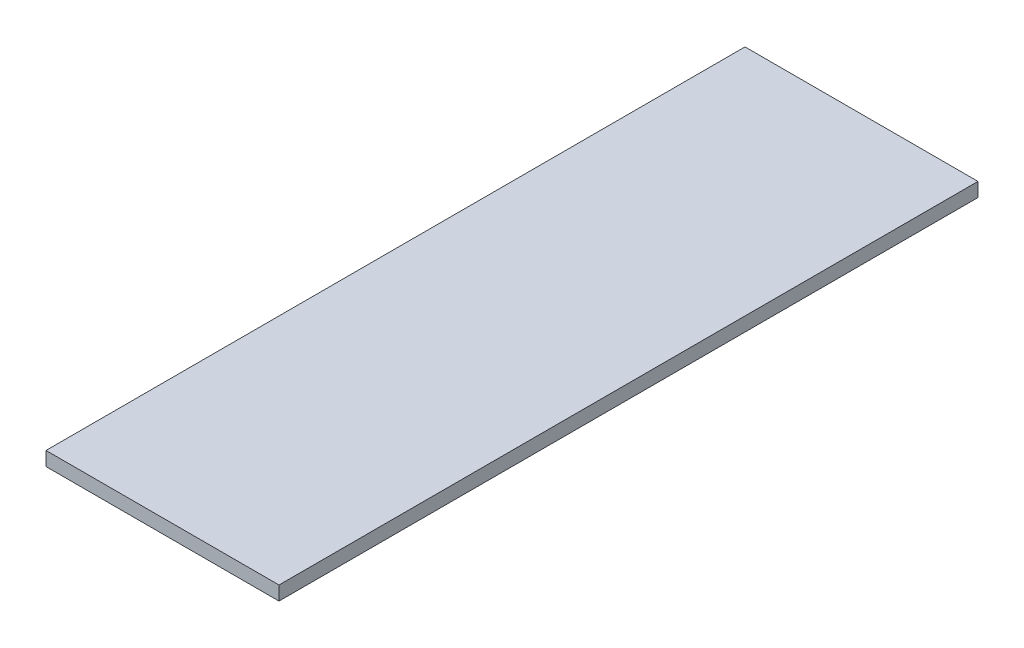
ISO-10303-21;
HEADER;
FILE_DESCRIPTION(('STEP AP214'),'2;1');
FILE_NAME('part.step','',(''),(''),'','','');
FILE_SCHEMA(('AUTOMOTIVE_DESIGN { 1 0 10303 214 1 1 1 1 }'));
ENDSEC;
DATA;
#1=APPLICATION_CONTEXT('core data for automotive mechanical design processes');
#2=APPLICATION_PROTOCOL_DEFINITION('international standard','automotive_design',2000,#1);
#3=PRODUCT_CONTEXT('',#1,'mechanical');
#4=PRODUCT('Part','Part','',(#3));
#5=PRODUCT_RELATED_PRODUCT_CATEGORY('part','',(#4));
#6=PRODUCT_DEFINITION_FORMATION('','',#4);
#7=PRODUCT_DEFINITION_CONTEXT('part definition',#1,'design');
#8=PRODUCT_DEFINITION('design','',#6,#7);
#9=PRODUCT_DEFINITION_SHAPE('','',#8);
#10=(LENGTH_UNIT() NAMED_UNIT(*) SI_UNIT(.MILLI.,.METRE.));
#11=(NAMED_UNIT(*) PLANE_ANGLE_UNIT() SI_UNIT($,.RADIAN.));
#12=(NAMED_UNIT(*) SI_UNIT($,.STERADIAN.) SOLID_ANGLE_UNIT());
#13=UNCERTAINTY_MEASURE_WITH_UNIT(LENGTH_MEASURE(1.E-05),#10,'distance_accuracy_value','');
#14=(GEOMETRIC_REPRESENTATION_CONTEXT(3) GLOBAL_UNCERTAINTY_ASSIGNED_CONTEXT((#13)) GLOBAL_UNIT_ASSIGNED_CONTEXT((#10,
#11,#12)) REPRESENTATION_CONTEXT('',''));
#15=CARTESIAN_POINT('',(0.,0.,0.));
#16=DIRECTION('',(0.,0.,1.));
#17=DIRECTION('',(1.,0.,0.));
#18=AXIS2_PLACEMENT_3D('',#15,#16,#17);
#19=CARTESIAN_POINT('',(-25.,3.,75.));
#20=DIRECTION('',(1.,0.,0.));
#21=DIRECTION('',(0.,0.,-1.));
#22=AXIS2_PLACEMENT_3D('',#19,#20,#21);
#23=PLANE('',#22);
#24=DIRECTION('',(0.,0.,1.));
#25=VECTOR('',#24,1.);
#26=CARTESIAN_POINT('',(-25.,0.,75.));
#27=LINE('',#26,#25);
#28=CARTESIAN_POINT('',(-25.,0.,-75.));
#29=VERTEX_POINT('',#28);
#30=CARTESIAN_POINT('',(-25.,0.,75.));
#31=VERTEX_POINT('',#30);
#32=EDGE_CURVE('E107',#29,#31,#27,.T.);
#33=ORIENTED_EDGE('',*,*,#32,.T.);
#34=DIRECTION('',(0.,-1.,0.));
#35=VECTOR('',#34,1.);
#36=CARTESIAN_POINT('',(-25.,3.,75.));
#37=LINE('',#36,#35);
#38=CARTESIAN_POINT('',(-25.,3.,75.));
#39=VERTEX_POINT('',#38);
#40=EDGE_CURVE('E11',#39,#31,#37,.T.);
#41=ORIENTED_EDGE('',*,*,#40,.F.);
#42=DIRECTION('',(0.,0.,1.));
#43=VECTOR('',#42,1.);
#44=CARTESIAN_POINT('',(-25.,3.,75.));
#45=LINE('',#44,#43);
#46=CARTESIAN_POINT('',(-25.,3.,-75.));
#47=VERTEX_POINT('',#46);
#48=EDGE_CURVE('E91',#47,#39,#45,.T.);
#49=ORIENTED_EDGE('',*,*,#48,.F.);
#50=DIRECTION('',(0.,-1.,0.));
#51=VECTOR('',#50,1.);
#52=CARTESIAN_POINT('',(-25.,3.,-75.));
#53=LINE('',#52,#51);
#54=EDGE_CURVE('E103',#47,#29,#53,.T.);
#55=ORIENTED_EDGE('',*,*,#54,.T.);
#56=EDGE_LOOP('',(#33,#41,#49,#55));
#57=FACE_BOUND('',#56,.T.);
#58=ADVANCED_FACE('F39',(#57),#23,.F.);
#59=CARTESIAN_POINT('',(25.,3.,75.));
#60=DIRECTION('',(0.,0.,-1.));
#61=DIRECTION('',(-1.,0.,0.));
#62=AXIS2_PLACEMENT_3D('',#59,#60,#61);
#63=PLANE('',#62);
#64=DIRECTION('',(1.,0.,0.));
#65=VECTOR('',#64,1.);
#66=CARTESIAN_POINT('',(25.,0.,75.));
#67=LINE('',#66,#65);
#68=CARTESIAN_POINT('',(25.,0.,75.));
#69=VERTEX_POINT('',#68);
#70=EDGE_CURVE('E96',#31,#69,#67,.T.);
#71=ORIENTED_EDGE('',*,*,#70,.T.);
#72=DIRECTION('',(0.,-1.,0.));
#73=VECTOR('',#72,1.);
#74=CARTESIAN_POINT('',(25.,3.,75.));
#75=LINE('',#74,#73);
#76=CARTESIAN_POINT('',(25.,3.,75.));
#77=VERTEX_POINT('',#76);
#78=EDGE_CURVE('E48',#77,#69,#75,.T.);
#79=ORIENTED_EDGE('',*,*,#78,.F.);
#80=DIRECTION('',(1.,0.,0.));
#81=VECTOR('',#80,1.);
#82=CARTESIAN_POINT('',(25.,3.,75.));
#83=LINE('',#82,#81);
#84=EDGE_CURVE('E86',#39,#77,#83,.T.);
#85=ORIENTED_EDGE('',*,*,#84,.F.);
#86=ORIENTED_EDGE('',*,*,#40,.T.);
#87=EDGE_LOOP('',(#71,#79,#85,#86));
#88=FACE_BOUND('',#87,.T.);
#89=ADVANCED_FACE('F95',(#88),#63,.F.);
#90=CARTESIAN_POINT('',(25.,3.,75.));
#91=DIRECTION('',(-1.,0.,0.));
#92=DIRECTION('',(0.,0.,1.));
#93=AXIS2_PLACEMENT_3D('',#90,#91,#92);
#94=PLANE('',#93);
#95=DIRECTION('',(0.,0.,-1.));
#96=VECTOR('',#95,1.);
#97=CARTESIAN_POINT('',(25.,0.,75.));
#98=LINE('',#97,#96);
#99=CARTESIAN_POINT('',(25.,0.,-75.));
#100=VERTEX_POINT('',#99);
#101=EDGE_CURVE('E73',#69,#100,#98,.T.);
#102=ORIENTED_EDGE('',*,*,#101,.T.);
#103=DIRECTION('',(0.,-1.,0.));
#104=VECTOR('',#103,1.);
#105=CARTESIAN_POINT('',(25.,3.,-75.));
#106=LINE('',#105,#104);
#107=CARTESIAN_POINT('',(25.,3.,-75.));
#108=VERTEX_POINT('',#107);
#109=EDGE_CURVE('E98',#108,#100,#106,.T.);
#110=ORIENTED_EDGE('',*,*,#109,.F.);
#111=DIRECTION('',(0.,0.,-1.));
#112=VECTOR('',#111,1.);
#113=CARTESIAN_POINT('',(25.,3.,75.));
#114=LINE('',#113,#112);
#115=EDGE_CURVE('E89',#77,#108,#114,.T.);
#116=ORIENTED_EDGE('',*,*,#115,.F.);
#117=ORIENTED_EDGE('',*,*,#78,.T.);
#118=EDGE_LOOP('',(#102,#110,#116,#117));
#119=FACE_BOUND('',#118,.T.);
#120=ADVANCED_FACE('F99',(#119),#94,.F.);
#121=CARTESIAN_POINT('',(25.,3.,-75.));
#122=DIRECTION('',(0.,0.,1.));
#123=DIRECTION('',(1.,0.,0.));
#124=AXIS2_PLACEMENT_3D('',#121,#122,#123);
#125=PLANE('',#124);
#126=DIRECTION('',(-1.,0.,0.));
#127=VECTOR('',#126,1.);
#128=CARTESIAN_POINT('',(25.,0.,-75.));
#129=LINE('',#128,#127);
#130=EDGE_CURVE('E79',#100,#29,#129,.T.);
#131=ORIENTED_EDGE('',*,*,#130,.T.);
#132=ORIENTED_EDGE('',*,*,#54,.F.);
#133=DIRECTION('',(-1.,0.,0.));
#134=VECTOR('',#133,1.);
#135=CARTESIAN_POINT('',(25.,3.,-75.));
#136=LINE('',#135,#134);
#137=EDGE_CURVE('E56',#108,#47,#136,.T.);
#138=ORIENTED_EDGE('',*,*,#137,.F.);
#139=ORIENTED_EDGE('',*,*,#109,.T.);
#140=EDGE_LOOP('',(#131,#132,#138,#139));
#141=FACE_BOUND('',#140,.T.);
#142=ADVANCED_FACE('F120',(#141),#125,.F.);
#143=CARTESIAN_POINT('',(0.,3.,0.));
#144=DIRECTION('',(0.,1.,0.));
#145=DIRECTION('',(0.,0.,1.));
#146=AXIS2_PLACEMENT_3D('',#143,#144,#145);
#147=PLANE('',#146);
#148=ORIENTED_EDGE('',*,*,#48,.T.);
#149=ORIENTED_EDGE('',*,*,#84,.T.);
#150=ORIENTED_EDGE('',*,*,#115,.T.);
#151=ORIENTED_EDGE('',*,*,#137,.T.);
#152=EDGE_LOOP('',(#148,#149,#150,#151));
#153=FACE_BOUND('',#152,.T.);
#154=ADVANCED_FACE('F87',(#153),#147,.T.);
#155=CARTESIAN_POINT('',(0.,0.,0.));
#156=DIRECTION('',(0.,1.,0.));
#157=DIRECTION('',(0.,0.,1.));
#158=AXIS2_PLACEMENT_3D('',#155,#156,#157);
#159=PLANE('',#158);
#160=ORIENTED_EDGE('',*,*,#32,.F.);
#161=ORIENTED_EDGE('',*,*,#130,.F.);
#162=ORIENTED_EDGE('',*,*,#101,.F.);
#163=ORIENTED_EDGE('',*,*,#70,.F.);
#164=EDGE_LOOP('',(#160,#161,#162,#163));
#165=FACE_BOUND('',#164,.T.);
#166=ADVANCED_FACE('F123',(#165),#159,.F.);
#167=CLOSED_SHELL('',(#58,#89,#120,#142,#154,#166));
#168=MANIFOLD_SOLID_BREP('B2',#167);
#169=ADVANCED_BREP_SHAPE_REPRESENTATION('',(#18,#168),#14);
#170=SHAPE_DEFINITION_REPRESENTATION(#9,#169);
ENDSEC;
END-ISO-10303-21;
